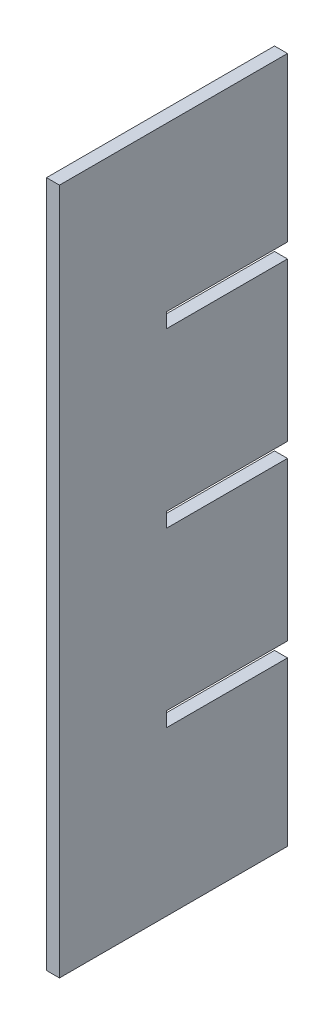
from build123d import *

# Parameters (mm, degrees)
CROQUIS16_W             = 1.5
CROQUIS16_H             = 79.5
SALIENTE_EXTRUIR9_DEPTH = 26.4
CROQUIS20_W             = 14
CROQUIS20_H             = 1.7
CORTAR_EXTRUIR2_DEPTH   = 1.5


with BuildPart() as part:
    # Croquis16 → Saliente-Extruir9 (new body)
    with BuildSketch(Plane.XY):
        with Locations((-17.5, 0)):
            Rectangle(CROQUIS16_W, CROQUIS16_H)
    extrude(amount=SALIENTE_EXTRUIR9_DEPTH)

    # Croquis20 → Cortar-Extruir2 (cut)
    with BuildSketch(Plane(origin=(-16.75, 0, 0), x_dir=(0, 0, -1), z_dir=(1, 0, 0))):
        with Locations((-7, -20)):
            Rectangle(CROQUIS20_W, CROQUIS20_H)
        with Locations((-7, 0)):
            Rectangle(CROQUIS20_W, CROQUIS20_H)
        with Locations((-7, 20)):
            Rectangle(CROQUIS20_W, CROQUIS20_H)
    extrude(amount=-CORTAR_EXTRUIR2_DEPTH, mode=Mode.SUBTRACT)


solid = part.part
